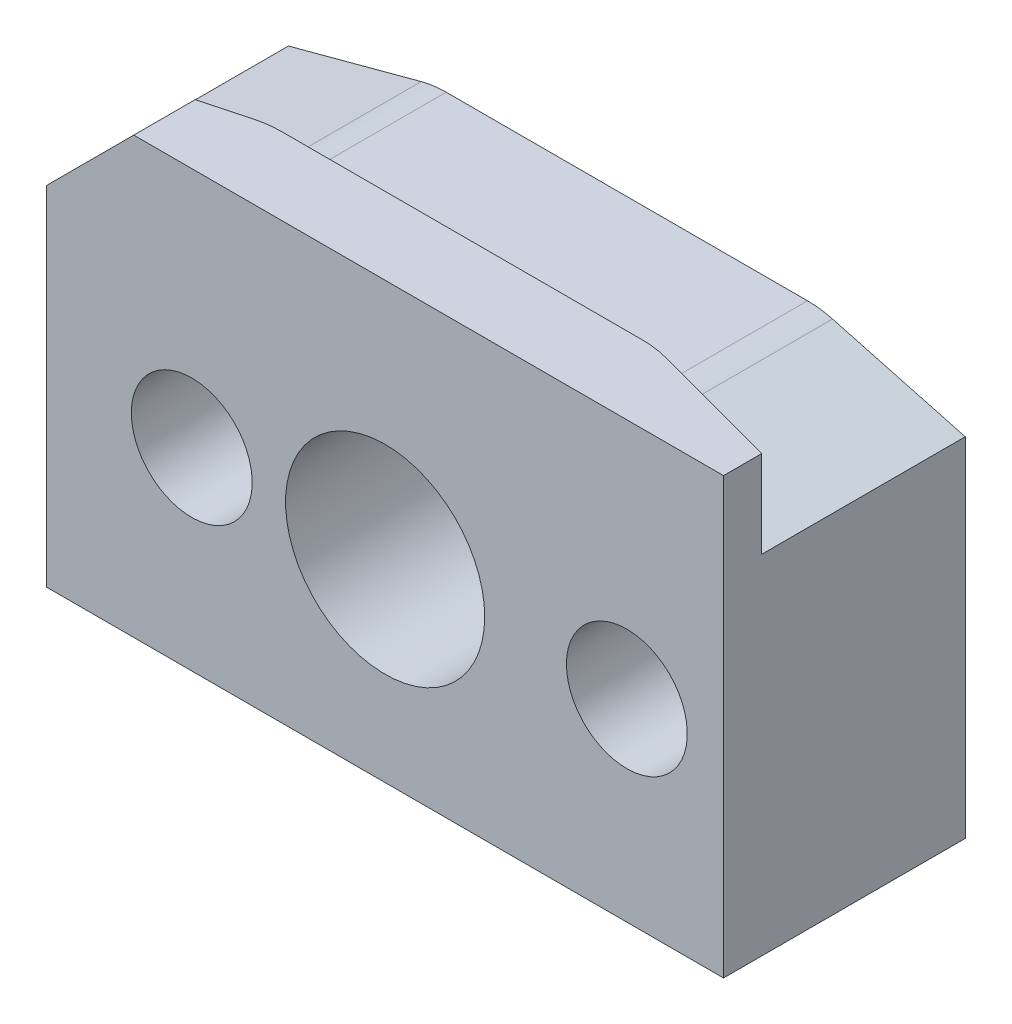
ISO-10303-21;
HEADER;
FILE_DESCRIPTION(('STEP AP214'),'2;1');
FILE_NAME('part.step','',(''),(''),'','','');
FILE_SCHEMA(('AUTOMOTIVE_DESIGN { 1 0 10303 214 1 1 1 1 }'));
ENDSEC;
DATA;
#1=APPLICATION_CONTEXT('core data for automotive mechanical design processes');
#2=APPLICATION_PROTOCOL_DEFINITION('international standard','automotive_design',2000,#1);
#3=PRODUCT_CONTEXT('',#1,'mechanical');
#4=PRODUCT('Part','Part','',(#3));
#5=PRODUCT_RELATED_PRODUCT_CATEGORY('part','',(#4));
#6=PRODUCT_DEFINITION_FORMATION('','',#4);
#7=PRODUCT_DEFINITION_CONTEXT('part definition',#1,'design');
#8=PRODUCT_DEFINITION('design','',#6,#7);
#9=PRODUCT_DEFINITION_SHAPE('','',#8);
#10=(LENGTH_UNIT() NAMED_UNIT(*) SI_UNIT(.MILLI.,.METRE.));
#11=(NAMED_UNIT(*) PLANE_ANGLE_UNIT() SI_UNIT($,.RADIAN.));
#12=(NAMED_UNIT(*) SI_UNIT($,.STERADIAN.) SOLID_ANGLE_UNIT());
#13=UNCERTAINTY_MEASURE_WITH_UNIT(LENGTH_MEASURE(1.E-05),#10,'distance_accuracy_value','');
#14=(GEOMETRIC_REPRESENTATION_CONTEXT(3) GLOBAL_UNCERTAINTY_ASSIGNED_CONTEXT((#13)) GLOBAL_UNIT_ASSIGNED_CONTEXT((#10,
#11,#12)) REPRESENTATION_CONTEXT('',''));
#15=CARTESIAN_POINT('',(0.,0.,0.));
#16=DIRECTION('',(0.,0.,1.));
#17=DIRECTION('',(1.,0.,0.));
#18=AXIS2_PLACEMENT_3D('',#15,#16,#17);
#19=CARTESIAN_POINT('',(-496.57,-79.4540739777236,15.875));
#20=DIRECTION('',(1.,0.,0.));
#21=DIRECTION('',(0.,0.,-1.));
#22=AXIS2_PLACEMENT_3D('',#19,#20,#21);
#23=PLANE('',#22);
#24=DIRECTION('',(0.,-1.,0.));
#25=VECTOR('',#24,1.);
#26=CARTESIAN_POINT('',(-496.57,-79.4540739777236,15.875));
#27=LINE('',#26,#25);
#28=CARTESIAN_POINT('',(-496.57,-79.4418579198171,15.875));
#29=VERTEX_POINT('',#28);
#30=CARTESIAN_POINT('',(-496.57,-102.301857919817,15.875));
#31=VERTEX_POINT('',#30);
#32=EDGE_CURVE('E188',#29,#31,#27,.T.);
#33=ORIENTED_EDGE('',*,*,#32,.F.);
#34=DIRECTION('',(0.,0.,-1.));
#35=VECTOR('',#34,1.);
#36=CARTESIAN_POINT('',(-496.57,-79.4418579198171,13.3722160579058));
#37=LINE('',#36,#35);
#38=CARTESIAN_POINT('',(-496.57,-79.4418579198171,13.3722160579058));
#39=VERTEX_POINT('',#38);
#40=EDGE_CURVE('E242',#29,#39,#37,.T.);
#41=ORIENTED_EDGE('',*,*,#40,.T.);
#42=DIRECTION('',(0.,-1.,0.));
#43=VECTOR('',#42,1.);
#44=CARTESIAN_POINT('',(-496.57,-79.4540739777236,13.3722160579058));
#45=LINE('',#44,#43);
#46=CARTESIAN_POINT('',(-496.57,-79.4540739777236,13.3722160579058));
#47=VERTEX_POINT('',#46);
#48=EDGE_CURVE('E261',#39,#47,#45,.T.);
#49=ORIENTED_EDGE('',*,*,#48,.T.);
#50=DIRECTION('',(0.,0.,-1.));
#51=VECTOR('',#50,1.);
#52=CARTESIAN_POINT('',(-496.57,-79.4540739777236,15.875));
#53=LINE('',#52,#51);
#54=CARTESIAN_POINT('',(-496.57,-79.4540739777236,0.));
#55=VERTEX_POINT('',#54);
#56=EDGE_CURVE('E181',#47,#55,#53,.T.);
#57=ORIENTED_EDGE('',*,*,#56,.T.);
#58=DIRECTION('',(0.,-1.,0.));
#59=VECTOR('',#58,1.);
#60=CARTESIAN_POINT('',(-496.57,-79.4540739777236,0.));
#61=LINE('',#60,#59);
#62=CARTESIAN_POINT('',(-496.57,-102.301857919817,0.));
#63=VERTEX_POINT('',#62);
#64=EDGE_CURVE('E192',#55,#63,#61,.T.);
#65=ORIENTED_EDGE('',*,*,#64,.T.);
#66=DIRECTION('',(0.,0.,-1.));
#67=VECTOR('',#66,1.);
#68=CARTESIAN_POINT('',(-496.57,-102.301857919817,15.875));
#69=LINE('',#68,#67);
#70=EDGE_CURVE('E265',#31,#63,#69,.T.);
#71=ORIENTED_EDGE('',*,*,#70,.F.);
#72=EDGE_LOOP('',(#33,#41,#49,#57,#65,#71));
#73=FACE_BOUND('',#72,.T.);
#74=ADVANCED_FACE('F60',(#73),#23,.F.);
#75=CARTESIAN_POINT('',(-452.12,-102.301857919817,15.875));
#76=DIRECTION('',(0.,1.,0.));
#77=DIRECTION('',(0.,0.,1.));
#78=AXIS2_PLACEMENT_3D('',#75,#76,#77);
#79=PLANE('',#78);
#80=DIRECTION('',(1.,0.,0.));
#81=VECTOR('',#80,1.);
#82=CARTESIAN_POINT('',(-452.12,-102.301857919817,0.));
#83=LINE('',#82,#81);
#84=CARTESIAN_POINT('',(-452.12,-102.301857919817,0.));
#85=VERTEX_POINT('',#84);
#86=EDGE_CURVE('E196',#63,#85,#83,.T.);
#87=ORIENTED_EDGE('',*,*,#86,.T.);
#88=DIRECTION('',(0.,0.,-1.));
#89=VECTOR('',#88,1.);
#90=CARTESIAN_POINT('',(-452.12,-102.301857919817,15.875));
#91=LINE('',#90,#89);
#92=CARTESIAN_POINT('',(-452.12,-102.301857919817,15.875));
#93=VERTEX_POINT('',#92);
#94=EDGE_CURVE('E384',#93,#85,#91,.T.);
#95=ORIENTED_EDGE('',*,*,#94,.F.);
#96=DIRECTION('',(1.,0.,0.));
#97=VECTOR('',#96,1.);
#98=CARTESIAN_POINT('',(-452.12,-102.301857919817,15.875));
#99=LINE('',#98,#97);
#100=EDGE_CURVE('E178',#31,#93,#99,.T.);
#101=ORIENTED_EDGE('',*,*,#100,.F.);
#102=ORIENTED_EDGE('',*,*,#70,.T.);
#103=EDGE_LOOP('',(#87,#95,#101,#102));
#104=FACE_BOUND('',#103,.T.);
#105=ADVANCED_FACE('F462',(#104),#79,.F.);
#106=CARTESIAN_POINT('',(-452.12,-79.4540739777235,15.875));
#107=DIRECTION('',(-1.,0.,0.));
#108=DIRECTION('',(0.,0.,1.));
#109=AXIS2_PLACEMENT_3D('',#106,#107,#108);
#110=PLANE('',#109);
#111=DIRECTION('',(0.,0.,-1.));
#112=VECTOR('',#111,1.);
#113=CARTESIAN_POINT('',(-452.12,-79.4540739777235,15.875));
#114=LINE('',#113,#112);
#115=CARTESIAN_POINT('',(-452.12,-79.4540739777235,13.3722160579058));
#116=VERTEX_POINT('',#115);
#117=CARTESIAN_POINT('',(-452.12,-79.4540739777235,0.));
#118=VERTEX_POINT('',#117);
#119=EDGE_CURVE('E378',#116,#118,#114,.T.);
#120=ORIENTED_EDGE('',*,*,#119,.F.);
#121=DIRECTION('',(0.,1.,0.));
#122=VECTOR('',#121,1.);
#123=CARTESIAN_POINT('',(-452.12,-73.7268579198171,13.3722160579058));
#124=LINE('',#123,#122);
#125=CARTESIAN_POINT('',(-452.12,-73.7268579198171,13.3722160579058));
#126=VERTEX_POINT('',#125);
#127=EDGE_CURVE('E172',#116,#126,#124,.T.);
#128=ORIENTED_EDGE('',*,*,#127,.T.);
#129=DIRECTION('',(0.,0.,1.));
#130=VECTOR('',#129,1.);
#131=CARTESIAN_POINT('',(-452.12,-73.7268579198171,15.875));
#132=LINE('',#131,#130);
#133=CARTESIAN_POINT('',(-452.12,-73.7268579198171,15.875));
#134=VERTEX_POINT('',#133);
#135=EDGE_CURVE('E158',#126,#134,#132,.T.);
#136=ORIENTED_EDGE('',*,*,#135,.T.);
#137=DIRECTION('',(0.,1.,0.));
#138=VECTOR('',#137,1.);
#139=CARTESIAN_POINT('',(-452.12,-79.4540739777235,15.875));
#140=LINE('',#139,#138);
#141=EDGE_CURVE('E170',#93,#134,#140,.T.);
#142=ORIENTED_EDGE('',*,*,#141,.F.);
#143=ORIENTED_EDGE('',*,*,#94,.T.);
#144=DIRECTION('',(0.,1.,0.));
#145=VECTOR('',#144,1.);
#146=CARTESIAN_POINT('',(-452.12,-79.4540739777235,0.));
#147=LINE('',#146,#145);
#148=EDGE_CURVE('E200',#85,#118,#147,.T.);
#149=ORIENTED_EDGE('',*,*,#148,.T.);
#150=EDGE_LOOP('',(#120,#128,#136,#142,#143,#149));
#151=FACE_BOUND('',#150,.T.);
#152=ADVANCED_FACE('F169',(#151),#110,.F.);
#153=CARTESIAN_POINT('',(-452.12,-79.4540739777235,15.875));
#154=DIRECTION('',(-0.258819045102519,-0.965925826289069,0.));
#155=DIRECTION('',(0.965925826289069,-0.258819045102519,0.));
#156=AXIS2_PLACEMENT_3D('',#153,#154,#155);
#157=PLANE('',#156);
#158=DIRECTION('',(0.,0.,-1.));
#159=VECTOR('',#158,1.);
#160=CARTESIAN_POINT('',(-460.837492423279,-77.1182289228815,15.875));
#161=LINE('',#160,#159);
#162=CARTESIAN_POINT('',(-460.837492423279,-77.1182289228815,11.0363710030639));
#163=VERTEX_POINT('',#162);
#164=CARTESIAN_POINT('',(-460.837492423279,-77.1182289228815,0.));
#165=VERTEX_POINT('',#164);
#166=EDGE_CURVE('E374',#163,#165,#161,.T.);
#167=ORIENTED_EDGE('',*,*,#166,.F.);
#168=DIRECTION('',(0.93511312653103,-0.25056280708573,0.25056280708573));
#169=VECTOR('',#168,1.);
#170=CARTESIAN_POINT('',(-451.533586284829,-79.6112030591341,13.5293451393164));
#171=LINE('',#170,#169);
#172=EDGE_CURVE('E400',#163,#116,#171,.T.);
#173=ORIENTED_EDGE('',*,*,#172,.T.);
#174=ORIENTED_EDGE('',*,*,#119,.T.);
#175=DIRECTION('',(-0.965925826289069,0.258819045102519,0.));
#176=VECTOR('',#175,1.);
#177=CARTESIAN_POINT('',(-452.12,-79.4540739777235,0.));
#178=LINE('',#177,#176);
#179=EDGE_CURVE('E204',#118,#165,#178,.T.);
#180=ORIENTED_EDGE('',*,*,#179,.T.);
#181=EDGE_LOOP('',(#167,#173,#174,#180));
#182=FACE_BOUND('',#181,.T.);
#183=ADVANCED_FACE('F449',(#182),#157,.F.);
#184=CARTESIAN_POINT('',(-462.48099335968,-83.2518579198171,15.875));
#185=DIRECTION('',(0.,0.,-1.));
#186=DIRECTION('',(-1.,0.,0.));
#187=AXIS2_PLACEMENT_3D('',#184,#185,#186);
#188=CYLINDRICAL_SURFACE('',#187,6.34999999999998);
#189=DIRECTION('',(0.,0.,-1.));
#190=VECTOR('',#189,1.);
#191=CARTESIAN_POINT('',(-462.48099335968,-76.9018579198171,15.875));
#192=LINE('',#191,#190);
#193=CARTESIAN_POINT('',(-462.48099335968,-76.9018579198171,10.8199999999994));
#194=VERTEX_POINT('',#193);
#195=CARTESIAN_POINT('',(-462.48099335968,-76.9018579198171,0.));
#196=VERTEX_POINT('',#195);
#197=EDGE_CURVE('E363',#194,#196,#192,.T.);
#198=ORIENTED_EDGE('',*,*,#197,.F.);
#199=CARTESIAN_POINT('',(-462.48099335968,-83.2518579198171,17.1699999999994));
#200=DIRECTION('',(0.,-0.707106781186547,-0.707106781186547));
#201=DIRECTION('',(0.,0.707106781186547,-0.707106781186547));
#202=AXIS2_PLACEMENT_3D('',#199,#200,#201);
#203=ELLIPSE('',#202,8.98025612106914,6.34999999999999);
#204=EDGE_CURVE('E243',#194,#163,#203,.T.);
#205=ORIENTED_EDGE('',*,*,#204,.T.);
#206=ORIENTED_EDGE('',*,*,#166,.T.);
#207=CARTESIAN_POINT('',(-462.48099335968,-83.2518579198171,0.));
#208=DIRECTION('',(0.,0.,1.));
#209=DIRECTION('',(1.,0.,0.));
#210=AXIS2_PLACEMENT_3D('',#207,#208,#209);
#211=CIRCLE('',#210,6.34999999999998);
#212=EDGE_CURVE('E208',#165,#196,#211,.T.);
#213=ORIENTED_EDGE('',*,*,#212,.T.);
#214=EDGE_LOOP('',(#198,#205,#206,#213));
#215=FACE_BOUND('',#214,.T.);
#216=ADVANCED_FACE('F369',(#215),#188,.T.);
#217=CARTESIAN_POINT('',(-462.48099335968,-76.9018579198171,15.875));
#218=DIRECTION('',(0.,-1.,0.));
#219=DIRECTION('',(1.,0.,0.));
#220=AXIS2_PLACEMENT_3D('',#217,#218,#219);
#221=PLANE('',#220);
#222=DIRECTION('',(0.,0.,-1.));
#223=VECTOR('',#222,1.);
#224=CARTESIAN_POINT('',(-486.20900664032,-76.9018579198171,15.875));
#225=LINE('',#224,#223);
#226=CARTESIAN_POINT('',(-486.20900664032,-76.9018579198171,10.8199999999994));
#227=VERTEX_POINT('',#226);
#228=CARTESIAN_POINT('',(-486.20900664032,-76.9018579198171,0.));
#229=VERTEX_POINT('',#228);
#230=EDGE_CURVE('E227',#227,#229,#225,.T.);
#231=ORIENTED_EDGE('',*,*,#230,.F.);
#232=DIRECTION('',(1.,0.,0.));
#233=VECTOR('',#232,1.);
#234=CARTESIAN_POINT('',(-462.48099335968,-76.9018579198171,10.8199999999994));
#235=LINE('',#234,#233);
#236=EDGE_CURVE('E163',#227,#194,#235,.T.);
#237=ORIENTED_EDGE('',*,*,#236,.T.);
#238=ORIENTED_EDGE('',*,*,#197,.T.);
#239=DIRECTION('',(-1.,0.,0.));
#240=VECTOR('',#239,1.);
#241=CARTESIAN_POINT('',(-462.48099335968,-76.9018579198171,0.));
#242=LINE('',#241,#240);
#243=EDGE_CURVE('E212',#196,#229,#242,.T.);
#244=ORIENTED_EDGE('',*,*,#243,.T.);
#245=EDGE_LOOP('',(#231,#237,#238,#244));
#246=FACE_BOUND('',#245,.T.);
#247=ADVANCED_FACE('F362',(#246),#221,.F.);
#248=CARTESIAN_POINT('',(-486.20900664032,-83.2518579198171,15.875));
#249=DIRECTION('',(0.,0.,-1.));
#250=DIRECTION('',(-1.,0.,0.));
#251=AXIS2_PLACEMENT_3D('',#248,#249,#250);
#252=CYLINDRICAL_SURFACE('',#251,6.35);
#253=DIRECTION('',(0.,0.,-1.));
#254=VECTOR('',#253,1.);
#255=CARTESIAN_POINT('',(-487.852507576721,-77.1182289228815,15.875));
#256=LINE('',#255,#254);
#257=CARTESIAN_POINT('',(-487.852507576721,-77.1182289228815,11.0363710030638));
#258=VERTEX_POINT('',#257);
#259=CARTESIAN_POINT('',(-487.852507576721,-77.1182289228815,0.));
#260=VERTEX_POINT('',#259);
#261=EDGE_CURVE('E186',#258,#260,#256,.T.);
#262=ORIENTED_EDGE('',*,*,#261,.F.);
#263=CARTESIAN_POINT('',(-486.20900664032,-83.2518579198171,17.1699999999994));
#264=DIRECTION('',(0.,-0.707106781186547,-0.707106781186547));
#265=DIRECTION('',(0.,0.707106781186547,-0.707106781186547));
#266=AXIS2_PLACEMENT_3D('',#263,#264,#265);
#267=ELLIPSE('',#266,8.98025612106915,6.35);
#268=EDGE_CURVE('E238',#258,#227,#267,.T.);
#269=ORIENTED_EDGE('',*,*,#268,.T.);
#270=ORIENTED_EDGE('',*,*,#230,.T.);
#271=CARTESIAN_POINT('',(-486.20900664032,-83.2518579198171,0.));
#272=DIRECTION('',(0.,0.,1.));
#273=DIRECTION('',(-1.,0.,0.));
#274=AXIS2_PLACEMENT_3D('',#271,#272,#273);
#275=CIRCLE('',#274,6.35);
#276=EDGE_CURVE('E216',#229,#260,#275,.T.);
#277=ORIENTED_EDGE('',*,*,#276,.T.);
#278=EDGE_LOOP('',(#262,#269,#270,#277));
#279=FACE_BOUND('',#278,.T.);
#280=ADVANCED_FACE('F431',(#279),#252,.T.);
#281=CARTESIAN_POINT('',(-487.852507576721,-77.1182289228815,15.875));
#282=DIRECTION('',(0.258819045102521,-0.965925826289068,0.));
#283=DIRECTION('',(0.965925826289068,0.258819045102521,0.));
#284=AXIS2_PLACEMENT_3D('',#281,#282,#283);
#285=PLANE('',#284);
#286=ORIENTED_EDGE('',*,*,#56,.F.);
#287=DIRECTION('',(0.93511312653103,0.250562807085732,-0.25056280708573));
#288=VECTOR('',#287,1.);
#289=CARTESIAN_POINT('',(-488.986220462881,-77.4220063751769,11.3401484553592));
#290=LINE('',#289,#288);
#291=EDGE_CURVE('E396',#47,#258,#290,.T.);
#292=ORIENTED_EDGE('',*,*,#291,.T.);
#293=ORIENTED_EDGE('',*,*,#261,.T.);
#294=DIRECTION('',(-0.965925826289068,-0.258819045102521,0.));
#295=VECTOR('',#294,1.);
#296=CARTESIAN_POINT('',(-487.852507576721,-77.1182289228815,0.));
#297=LINE('',#296,#295);
#298=EDGE_CURVE('E220',#260,#55,#297,.T.);
#299=ORIENTED_EDGE('',*,*,#298,.T.);
#300=EDGE_LOOP('',(#286,#292,#293,#299));
#301=FACE_BOUND('',#300,.T.);
#302=ADVANCED_FACE('F436',(#301),#285,.F.);
#303=CARTESIAN_POINT('',(-462.48099335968,-83.2518579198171,15.875));
#304=DIRECTION('',(0.,0.,1.));
#305=DIRECTION('',(1.,0.,0.));
#306=AXIS2_PLACEMENT_3D('',#303,#304,#305);
#307=PLANE('',#306);
#308=CARTESIAN_POINT('',(-487.045,-89.6018579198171,15.875));
#309=DIRECTION('',(0.,0.,-1.));
#310=DIRECTION('',(-1.,0.,0.));
#311=AXIS2_PLACEMENT_3D('',#308,#309,#310);
#312=CIRCLE('',#311,3.96875000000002);
#313=CARTESIAN_POINT('',(-491.01375,-89.6018579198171,15.875));
#314=VERTEX_POINT('',#313);
#315=EDGE_CURVE('E267',#314,#314,#312,.T.);
#316=ORIENTED_EDGE('',*,*,#315,.T.);
#317=EDGE_LOOP('',(#316));
#318=FACE_BOUND('',#317,.T.);
#319=CARTESIAN_POINT('',(-458.47,-89.6018579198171,15.875));
#320=DIRECTION('',(0.,0.,-1.));
#321=DIRECTION('',(-1.,0.,0.));
#322=AXIS2_PLACEMENT_3D('',#319,#320,#321);
#323=CIRCLE('',#322,3.96875000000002);
#324=CARTESIAN_POINT('',(-462.43875,-89.6018579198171,15.875));
#325=VERTEX_POINT('',#324);
#326=EDGE_CURVE('E278',#325,#325,#323,.T.);
#327=ORIENTED_EDGE('',*,*,#326,.T.);
#328=EDGE_LOOP('',(#327));
#329=FACE_BOUND('',#328,.T.);
#330=CARTESIAN_POINT('',(-474.345,-89.6018579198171,15.875));
#331=DIRECTION('',(0.,0.,1.));
#332=DIRECTION('',(1.,0.,0.));
#333=AXIS2_PLACEMENT_3D('',#330,#331,#332);
#334=CIRCLE('',#333,6.54050000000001);
#335=CARTESIAN_POINT('',(-467.8045,-89.6018579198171,15.875));
#336=VERTEX_POINT('',#335);
#337=EDGE_CURVE('E174',#336,#336,#334,.T.);
#338=ORIENTED_EDGE('',*,*,#337,.F.);
#339=EDGE_LOOP('',(#338));
#340=FACE_BOUND('',#339,.T.);
#341=DIRECTION('',(1.,0.,0.));
#342=VECTOR('',#341,1.);
#343=CARTESIAN_POINT('',(-525.588677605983,-73.7268579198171,15.875));
#344=LINE('',#343,#342);
#345=CARTESIAN_POINT('',(-490.855,-73.7268579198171,15.875));
#346=VERTEX_POINT('',#345);
#347=EDGE_CURVE('E154',#346,#134,#344,.T.);
#348=ORIENTED_EDGE('',*,*,#347,.F.);
#349=DIRECTION('',(-0.707106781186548,-0.707106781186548,0.));
#350=VECTOR('',#349,1.);
#351=CARTESIAN_POINT('',(-481.43049667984,-64.302354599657,15.875));
#352=LINE('',#351,#350);
#353=EDGE_CURVE('E12',#346,#29,#352,.T.);
#354=ORIENTED_EDGE('',*,*,#353,.T.);
#355=ORIENTED_EDGE('',*,*,#32,.T.);
#356=ORIENTED_EDGE('',*,*,#100,.T.);
#357=ORIENTED_EDGE('',*,*,#141,.T.);
#358=EDGE_LOOP('',(#348,#354,#355,#356,#357));
#359=FACE_BOUND('',#358,.T.);
#360=ADVANCED_FACE('F176',(#318,#329,#340,#359),#307,.T.);
#361=CARTESIAN_POINT('',(-462.48099335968,-83.2518579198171,0.));
#362=DIRECTION('',(0.,0.,1.));
#363=DIRECTION('',(1.,0.,0.));
#364=AXIS2_PLACEMENT_3D('',#361,#362,#363);
#365=PLANE('',#364);
#366=CARTESIAN_POINT('',(-487.045,-89.6018579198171,0.));
#367=DIRECTION('',(0.,0.,-1.));
#368=DIRECTION('',(-1.,0.,0.));
#369=AXIS2_PLACEMENT_3D('',#366,#367,#368);
#370=CIRCLE('',#369,3.96875000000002);
#371=CARTESIAN_POINT('',(-491.01375,-89.6018579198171,0.));
#372=VERTEX_POINT('',#371);
#373=EDGE_CURVE('E272',#372,#372,#370,.T.);
#374=ORIENTED_EDGE('',*,*,#373,.F.);
#375=EDGE_LOOP('',(#374));
#376=FACE_BOUND('',#375,.T.);
#377=CARTESIAN_POINT('',(-458.47,-89.6018579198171,0.));
#378=DIRECTION('',(0.,0.,-1.));
#379=DIRECTION('',(-1.,0.,0.));
#380=AXIS2_PLACEMENT_3D('',#377,#378,#379);
#381=CIRCLE('',#380,3.96875000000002);
#382=CARTESIAN_POINT('',(-462.43875,-89.6018579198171,0.));
#383=VERTEX_POINT('',#382);
#384=EDGE_CURVE('E283',#383,#383,#381,.T.);
#385=ORIENTED_EDGE('',*,*,#384,.F.);
#386=EDGE_LOOP('',(#385));
#387=FACE_BOUND('',#386,.T.);
#388=CARTESIAN_POINT('',(-474.345,-89.6018579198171,0.));
#389=DIRECTION('',(0.,0.,1.));
#390=DIRECTION('',(1.,0.,0.));
#391=AXIS2_PLACEMENT_3D('',#388,#389,#390);
#392=CIRCLE('',#391,4.36880000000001);
#393=CARTESIAN_POINT('',(-469.9762,-89.6018579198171,0.));
#394=VERTEX_POINT('',#393);
#395=EDGE_CURVE('E290',#394,#394,#392,.T.);
#396=ORIENTED_EDGE('',*,*,#395,.T.);
#397=EDGE_LOOP('',(#396));
#398=FACE_BOUND('',#397,.T.);
#399=ORIENTED_EDGE('',*,*,#64,.F.);
#400=ORIENTED_EDGE('',*,*,#298,.F.);
#401=ORIENTED_EDGE('',*,*,#276,.F.);
#402=ORIENTED_EDGE('',*,*,#243,.F.);
#403=ORIENTED_EDGE('',*,*,#212,.F.);
#404=ORIENTED_EDGE('',*,*,#179,.F.);
#405=ORIENTED_EDGE('',*,*,#148,.F.);
#406=ORIENTED_EDGE('',*,*,#86,.F.);
#407=EDGE_LOOP('',(#399,#400,#401,#402,#403,#404,#405,#406));
#408=FACE_BOUND('',#407,.T.);
#409=ADVANCED_FACE('F454',(#376,#387,#398,#408),#365,.F.);
#410=CARTESIAN_POINT('',(-525.588677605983,-102.301857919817,10.8199999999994));
#411=DIRECTION('',(0.,0.,-1.));
#412=DIRECTION('',(-1.,0.,0.));
#413=AXIS2_PLACEMENT_3D('',#410,#411,#412);
#414=PLANE('',#413);
#415=DIRECTION('',(1.,0.,0.));
#416=VECTOR('',#415,1.);
#417=CARTESIAN_POINT('',(-525.588677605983,-73.7268579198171,10.8199999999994));
#418=LINE('',#417,#416);
#419=CARTESIAN_POINT('',(-486.20900664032,-73.7268579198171,10.8199999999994));
#420=VERTEX_POINT('',#419);
#421=CARTESIAN_POINT('',(-462.48099335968,-73.7268579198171,10.8199999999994));
#422=VERTEX_POINT('',#421);
#423=EDGE_CURVE('E164',#420,#422,#418,.T.);
#424=ORIENTED_EDGE('',*,*,#423,.T.);
#425=DIRECTION('',(0.,-1.,0.));
#426=VECTOR('',#425,1.);
#427=CARTESIAN_POINT('',(-462.48099335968,-102.301857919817,10.8199999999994));
#428=LINE('',#427,#426);
#429=EDGE_CURVE('E407',#422,#194,#428,.T.);
#430=ORIENTED_EDGE('',*,*,#429,.T.);
#431=ORIENTED_EDGE('',*,*,#236,.F.);
#432=DIRECTION('',(0.,1.,0.));
#433=VECTOR('',#432,1.);
#434=CARTESIAN_POINT('',(-486.20900664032,-102.301857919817,10.8199999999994));
#435=LINE('',#434,#433);
#436=EDGE_CURVE('E404',#227,#420,#435,.T.);
#437=ORIENTED_EDGE('',*,*,#436,.T.);
#438=EDGE_LOOP('',(#424,#430,#431,#437));
#439=FACE_BOUND('',#438,.T.);
#440=ADVANCED_FACE('F439',(#439),#414,.T.);
#441=CARTESIAN_POINT('',(-525.588677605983,-73.7268579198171,15.875));
#442=DIRECTION('',(0.,1.,0.));
#443=DIRECTION('',(0.,0.,1.));
#444=AXIS2_PLACEMENT_3D('',#441,#442,#443);
#445=PLANE('',#444);
#446=DIRECTION('',(-0.965925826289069,0.,0.258819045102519));
#447=VECTOR('',#446,1.);
#448=CARTESIAN_POINT('',(-524.270490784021,-73.7268579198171,20.7945401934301));
#449=LINE('',#448,#447);
#450=CARTESIAN_POINT('',(-487.852507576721,-73.7268579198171,11.0363710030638));
#451=VERTEX_POINT('',#450);
#452=CARTESIAN_POINT('',(-490.855,-73.7268579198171,11.840886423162));
#453=VERTEX_POINT('',#452);
#454=EDGE_CURVE('E391',#451,#453,#449,.T.);
#455=ORIENTED_EDGE('',*,*,#454,.T.);
#456=DIRECTION('',(0.,0.,1.));
#457=VECTOR('',#456,1.);
#458=CARTESIAN_POINT('',(-490.855,-73.7268579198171,15.875));
#459=LINE('',#458,#457);
#460=EDGE_CURVE('E70',#453,#346,#459,.T.);
#461=ORIENTED_EDGE('',*,*,#460,.T.);
#462=ORIENTED_EDGE('',*,*,#347,.T.);
#463=ORIENTED_EDGE('',*,*,#135,.F.);
#464=DIRECTION('',(-0.965925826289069,0.,-0.258819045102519));
#465=VECTOR('',#464,1.);
#466=CARTESIAN_POINT('',(-520.041513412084,-73.7268579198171,-4.82729860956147));
#467=LINE('',#466,#465);
#468=CARTESIAN_POINT('',(-460.837492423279,-73.7268579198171,11.0363710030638));
#469=VERTEX_POINT('',#468);
#470=EDGE_CURVE('E264',#126,#469,#467,.T.);
#471=ORIENTED_EDGE('',*,*,#470,.T.);
#472=CARTESIAN_POINT('',(-462.48099335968,-73.7268579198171,17.1699999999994));
#473=DIRECTION('',(0.,1.,0.));
#474=DIRECTION('',(0.,0.,1.));
#475=AXIS2_PLACEMENT_3D('',#472,#473,#474);
#476=CIRCLE('',#475,6.35);
#477=EDGE_CURVE('E415',#469,#422,#476,.T.);
#478=ORIENTED_EDGE('',*,*,#477,.T.);
#479=ORIENTED_EDGE('',*,*,#423,.F.);
#480=CARTESIAN_POINT('',(-486.20900664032,-73.7268579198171,17.1699999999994));
#481=DIRECTION('',(0.,1.,0.));
#482=DIRECTION('',(0.,0.,1.));
#483=AXIS2_PLACEMENT_3D('',#480,#481,#482);
#484=CIRCLE('',#483,6.35);
#485=EDGE_CURVE('E413',#420,#451,#484,.T.);
#486=ORIENTED_EDGE('',*,*,#485,.T.);
#487=EDGE_LOOP('',(#455,#461,#462,#463,#471,#478,#479,#486));
#488=FACE_BOUND('',#487,.T.);
#489=ADVANCED_FACE('F156',(#488),#445,.T.);
#490=CARTESIAN_POINT('',(-496.57,-79.4540739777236,13.3722160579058));
#491=DIRECTION('',(-0.258819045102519,0.,-0.965925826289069));
#492=DIRECTION('',(0.,1.,0.));
#493=AXIS2_PLACEMENT_3D('',#490,#491,#492);
#494=PLANE('',#493);
#495=ORIENTED_EDGE('',*,*,#48,.F.);
#496=DIRECTION('',(0.694746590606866,0.694746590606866,-0.186156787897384));
#497=VECTOR('',#496,1.);
#498=CARTESIAN_POINT('',(-496.575896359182,-79.4477542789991,13.3737959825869));
#499=LINE('',#498,#497);
#500=EDGE_CURVE('E84',#39,#453,#499,.T.);
#501=ORIENTED_EDGE('',*,*,#500,.T.);
#502=ORIENTED_EDGE('',*,*,#454,.F.);
#503=DIRECTION('',(0.,1.,0.));
#504=VECTOR('',#503,1.);
#505=CARTESIAN_POINT('',(-487.852507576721,-79.4540739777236,11.0363710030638));
#506=LINE('',#505,#504);
#507=EDGE_CURVE('E418',#451,#258,#506,.F.);
#508=ORIENTED_EDGE('',*,*,#507,.T.);
#509=ORIENTED_EDGE('',*,*,#291,.F.);
#510=EDGE_LOOP('',(#495,#501,#502,#508,#509));
#511=FACE_BOUND('',#510,.T.);
#512=ADVANCED_FACE('F427',(#511),#494,.T.);
#513=CARTESIAN_POINT('',(-452.12,-79.4540739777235,13.3722160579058));
#514=DIRECTION('',(0.258819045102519,0.,-0.965925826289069));
#515=DIRECTION('',(0.,-1.,0.));
#516=AXIS2_PLACEMENT_3D('',#513,#514,#515);
#517=PLANE('',#516);
#518=ORIENTED_EDGE('',*,*,#172,.F.);
#519=DIRECTION('',(0.,-1.,0.));
#520=VECTOR('',#519,1.);
#521=CARTESIAN_POINT('',(-460.837492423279,-79.4540739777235,11.0363710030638));
#522=LINE('',#521,#520);
#523=EDGE_CURVE('E410',#163,#469,#522,.F.);
#524=ORIENTED_EDGE('',*,*,#523,.T.);
#525=ORIENTED_EDGE('',*,*,#470,.F.);
#526=ORIENTED_EDGE('',*,*,#127,.F.);
#527=EDGE_LOOP('',(#518,#524,#525,#526));
#528=FACE_BOUND('',#527,.T.);
#529=ADVANCED_FACE('F447',(#528),#517,.T.);
#530=CARTESIAN_POINT('',(-462.48099335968,-102.301857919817,17.1699999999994));
#531=DIRECTION('',(0.,-1.,0.));
#532=DIRECTION('',(0.,0.,-1.));
#533=AXIS2_PLACEMENT_3D('',#530,#531,#532);
#534=CYLINDRICAL_SURFACE('',#533,6.35);
#535=ORIENTED_EDGE('',*,*,#477,.F.);
#536=ORIENTED_EDGE('',*,*,#523,.F.);
#537=ORIENTED_EDGE('',*,*,#204,.F.);
#538=ORIENTED_EDGE('',*,*,#429,.F.);
#539=EDGE_LOOP('',(#535,#536,#537,#538));
#540=FACE_BOUND('',#539,.T.);
#541=ADVANCED_FACE('F444',(#540),#534,.T.);
#542=CARTESIAN_POINT('',(-486.20900664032,-102.301857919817,17.1699999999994));
#543=DIRECTION('',(0.,1.,0.));
#544=DIRECTION('',(0.,0.,1.));
#545=AXIS2_PLACEMENT_3D('',#542,#543,#544);
#546=CYLINDRICAL_SURFACE('',#545,6.35);
#547=ORIENTED_EDGE('',*,*,#268,.F.);
#548=ORIENTED_EDGE('',*,*,#507,.F.);
#549=ORIENTED_EDGE('',*,*,#485,.F.);
#550=ORIENTED_EDGE('',*,*,#436,.F.);
#551=EDGE_LOOP('',(#547,#548,#549,#550));
#552=FACE_BOUND('',#551,.T.);
#553=ADVANCED_FACE('F437',(#552),#546,.T.);
#554=CARTESIAN_POINT('',(-474.345,-89.6018579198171,15.875));
#555=DIRECTION('',(0.,0.,1.));
#556=DIRECTION('',(1.,0.,0.));
#557=AXIS2_PLACEMENT_3D('',#554,#555,#556);
#558=CYLINDRICAL_SURFACE('',#557,6.54050000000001);
#559=CARTESIAN_POINT('',(-474.345,-89.6018579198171,6.223));
#560=DIRECTION('',(0.,0.,1.));
#561=DIRECTION('',(1.,0.,0.));
#562=AXIS2_PLACEMENT_3D('',#559,#560,#561);
#563=CIRCLE('',#562,6.54050000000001);
#564=CARTESIAN_POINT('',(-467.8045,-89.6018579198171,6.223));
#565=VERTEX_POINT('',#564);
#566=EDGE_CURVE('E302',#565,#565,#563,.T.);
#567=ORIENTED_EDGE('',*,*,#566,.F.);
#568=EDGE_LOOP('',(#567));
#569=FACE_BOUND('',#568,.T.);
#570=ORIENTED_EDGE('',*,*,#337,.T.);
#571=EDGE_LOOP('',(#570));
#572=FACE_BOUND('',#571,.T.);
#573=ADVANCED_FACE('F485',(#569,#572),#558,.F.);
#574=CARTESIAN_POINT('',(-469.9762,-89.6018579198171,6.223));
#575=DIRECTION('',(0.,0.,-1.));
#576=DIRECTION('',(-1.,0.,0.));
#577=AXIS2_PLACEMENT_3D('',#574,#575,#576);
#578=PLANE('',#577);
#579=CARTESIAN_POINT('',(-474.345,-89.6018579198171,6.223));
#580=DIRECTION('',(0.,0.,1.));
#581=DIRECTION('',(1.,0.,0.));
#582=AXIS2_PLACEMENT_3D('',#579,#580,#581);
#583=CIRCLE('',#582,4.36880000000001);
#584=CARTESIAN_POINT('',(-469.9762,-89.6018579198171,6.223));
#585=VERTEX_POINT('',#584);
#586=EDGE_CURVE('E296',#585,#585,#583,.T.);
#587=ORIENTED_EDGE('',*,*,#586,.F.);
#588=EDGE_LOOP('',(#587));
#589=FACE_BOUND('',#588,.T.);
#590=ORIENTED_EDGE('',*,*,#566,.T.);
#591=EDGE_LOOP('',(#590));
#592=FACE_BOUND('',#591,.T.);
#593=ADVANCED_FACE('F490',(#589,#592),#578,.F.);
#594=CARTESIAN_POINT('',(-474.345,-89.6018579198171,15.875));
#595=DIRECTION('',(0.,0.,1.));
#596=DIRECTION('',(1.,0.,0.));
#597=AXIS2_PLACEMENT_3D('',#594,#595,#596);
#598=CYLINDRICAL_SURFACE('',#597,4.36880000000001);
#599=ORIENTED_EDGE('',*,*,#395,.F.);
#600=EDGE_LOOP('',(#599));
#601=FACE_BOUND('',#600,.T.);
#602=ORIENTED_EDGE('',*,*,#586,.T.);
#603=EDGE_LOOP('',(#602));
#604=FACE_BOUND('',#603,.T.);
#605=ADVANCED_FACE('F496',(#601,#604),#598,.F.);
#606=CARTESIAN_POINT('',(-458.47,-89.6018579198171,0.));
#607=DIRECTION('',(0.,0.,-1.));
#608=DIRECTION('',(-1.,0.,0.));
#609=AXIS2_PLACEMENT_3D('',#606,#607,#608);
#610=CYLINDRICAL_SURFACE('',#609,3.96875000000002);
#611=ORIENTED_EDGE('',*,*,#326,.F.);
#612=EDGE_LOOP('',(#611));
#613=FACE_BOUND('',#612,.T.);
#614=ORIENTED_EDGE('',*,*,#384,.T.);
#615=EDGE_LOOP('',(#614));
#616=FACE_BOUND('',#615,.T.);
#617=ADVANCED_FACE('F593',(#613,#616),#610,.F.);
#618=CARTESIAN_POINT('',(-487.045,-89.6018579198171,0.));
#619=DIRECTION('',(0.,0.,-1.));
#620=DIRECTION('',(-1.,0.,0.));
#621=AXIS2_PLACEMENT_3D('',#618,#619,#620);
#622=CYLINDRICAL_SURFACE('',#621,3.96875000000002);
#623=ORIENTED_EDGE('',*,*,#315,.F.);
#624=EDGE_LOOP('',(#623));
#625=FACE_BOUND('',#624,.T.);
#626=ORIENTED_EDGE('',*,*,#373,.T.);
#627=EDGE_LOOP('',(#626));
#628=FACE_BOUND('',#627,.T.);
#629=ADVANCED_FACE('F605',(#625,#628),#622,.F.);
#630=CARTESIAN_POINT('',(-496.57,-79.4418579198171,15.875));
#631=DIRECTION('',(-0.707106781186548,0.707106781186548,0.));
#632=DIRECTION('',(0.,0.,1.));
#633=AXIS2_PLACEMENT_3D('',#630,#631,#632);
#634=PLANE('',#633);
#635=ORIENTED_EDGE('',*,*,#353,.F.);
#636=ORIENTED_EDGE('',*,*,#460,.F.);
#637=ORIENTED_EDGE('',*,*,#500,.F.);
#638=ORIENTED_EDGE('',*,*,#40,.F.);
#639=EDGE_LOOP('',(#635,#636,#637,#638));
#640=FACE_BOUND('',#639,.T.);
#641=ADVANCED_FACE('F63',(#640),#634,.T.);
#642=CLOSED_SHELL('',(#74,#105,#152,#183,#216,#247,#280,#302,#360,#409,#440,#489,#512,#529,#541,
#553,#573,#593,#605,#617,#629,#641));
#643=MANIFOLD_SOLID_BREP('B2',#642);
#644=ADVANCED_BREP_SHAPE_REPRESENTATION('',(#18,#643),#14);
#645=SHAPE_DEFINITION_REPRESENTATION(#9,#644);
ENDSEC;
END-ISO-10303-21;
